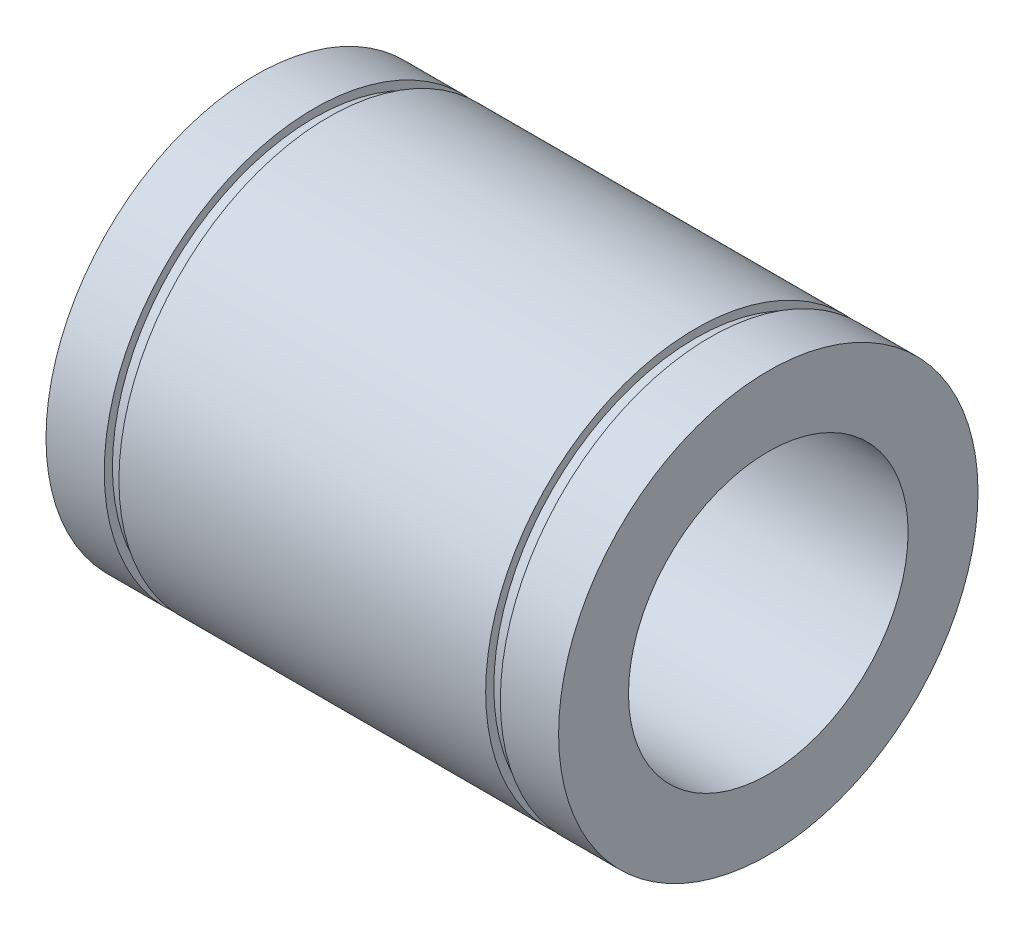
ISO-10303-21;
HEADER;
FILE_DESCRIPTION(('STEP AP214'),'2;1');
FILE_NAME('part.step','',(''),(''),'','','');
FILE_SCHEMA(('AUTOMOTIVE_DESIGN { 1 0 10303 214 1 1 1 1 }'));
ENDSEC;
DATA;
#1=APPLICATION_CONTEXT('core data for automotive mechanical design processes');
#2=APPLICATION_PROTOCOL_DEFINITION('international standard','automotive_design',2000,#1);
#3=PRODUCT_CONTEXT('',#1,'mechanical');
#4=PRODUCT('Part','Part','',(#3));
#5=PRODUCT_RELATED_PRODUCT_CATEGORY('part','',(#4));
#6=PRODUCT_DEFINITION_FORMATION('','',#4);
#7=PRODUCT_DEFINITION_CONTEXT('part definition',#1,'design');
#8=PRODUCT_DEFINITION('design','',#6,#7);
#9=PRODUCT_DEFINITION_SHAPE('','',#8);
#10=(LENGTH_UNIT() NAMED_UNIT(*) SI_UNIT(.MILLI.,.METRE.));
#11=(NAMED_UNIT(*) PLANE_ANGLE_UNIT() SI_UNIT($,.RADIAN.));
#12=(NAMED_UNIT(*) SI_UNIT($,.STERADIAN.) SOLID_ANGLE_UNIT());
#13=UNCERTAINTY_MEASURE_WITH_UNIT(LENGTH_MEASURE(1.E-05),#10,'distance_accuracy_value','');
#14=(GEOMETRIC_REPRESENTATION_CONTEXT(3) GLOBAL_UNCERTAINTY_ASSIGNED_CONTEXT((#13)) GLOBAL_UNIT_ASSIGNED_CONTEXT((#10,
#11,#12)) REPRESENTATION_CONTEXT('',''));
#15=CARTESIAN_POINT('',(0.,0.,0.));
#16=DIRECTION('',(0.,0.,1.));
#17=DIRECTION('',(1.,0.,0.));
#18=AXIS2_PLACEMENT_3D('',#15,#16,#17);
#19=CARTESIAN_POINT('',(55.,0.,0.));
#20=DIRECTION('',(-1.,0.,0.));
#21=DIRECTION('',(0.,0.,-1.));
#22=AXIS2_PLACEMENT_3D('',#19,#20,#21);
#23=CYLINDRICAL_SURFACE('',#22,45.);
#24=CARTESIAN_POINT('',(-55.,0.,0.));
#25=DIRECTION('',(1.,0.,0.));
#26=DIRECTION('',(0.,0.,-1.));
#27=AXIS2_PLACEMENT_3D('',#24,#25,#26);
#28=CIRCLE('',#27,45.);
#29=CARTESIAN_POINT('',(-55.,0.,-45.));
#30=VERTEX_POINT('',#29);
#31=CARTESIAN_POINT('',(-55.,0.,45.));
#32=VERTEX_POINT('',#31);
#33=EDGE_CURVE('E210',#30,#32,#28,.T.);
#34=ORIENTED_EDGE('',*,*,#33,.T.);
#35=DIRECTION('',(1.,0.,0.));
#36=VECTOR('',#35,1.);
#37=CARTESIAN_POINT('',(55.,0.,45.));
#38=LINE('',#37,#36);
#39=CARTESIAN_POINT('',(-42.5,0.,45.));
#40=VERTEX_POINT('',#39);
#41=EDGE_CURVE('E10',#32,#40,#38,.T.);
#42=ORIENTED_EDGE('',*,*,#41,.T.);
#43=CARTESIAN_POINT('',(-42.5,0.,0.));
#44=DIRECTION('',(1.,0.,0.));
#45=DIRECTION('',(0.,0.,-1.));
#46=AXIS2_PLACEMENT_3D('',#43,#44,#45);
#47=CIRCLE('',#46,45.);
#48=CARTESIAN_POINT('',(-42.5,0.,-45.));
#49=VERTEX_POINT('',#48);
#50=EDGE_CURVE('E59',#49,#40,#47,.T.);
#51=ORIENTED_EDGE('',*,*,#50,.F.);
#52=CARTESIAN_POINT('',(-42.5,0.,0.));
#53=DIRECTION('',(1.,0.,0.));
#54=DIRECTION('',(0.,0.,-1.));
#55=AXIS2_PLACEMENT_3D('',#52,#53,#54);
#56=CIRCLE('',#55,45.);
#57=EDGE_CURVE('E25',#40,#49,#56,.T.);
#58=ORIENTED_EDGE('',*,*,#57,.F.);
#59=ORIENTED_EDGE('',*,*,#41,.F.);
#60=CARTESIAN_POINT('',(-55.,0.,0.));
#61=DIRECTION('',(1.,0.,0.));
#62=DIRECTION('',(0.,0.,-1.));
#63=AXIS2_PLACEMENT_3D('',#60,#61,#62);
#64=CIRCLE('',#63,45.);
#65=EDGE_CURVE('E208',#32,#30,#64,.T.);
#66=ORIENTED_EDGE('',*,*,#65,.T.);
#67=EDGE_LOOP('',(#34,#42,#51,#58,#59,#66));
#68=FACE_BOUND('',#67,.T.);
#69=ADVANCED_FACE('F16',(#68),#23,.T.);
#70=CARTESIAN_POINT('',(-42.5,43.25,0.));
#71=DIRECTION('',(1.,0.,0.));
#72=DIRECTION('',(0.,1.,0.));
#73=AXIS2_PLACEMENT_3D('',#70,#71,#72);
#74=PLANE('',#73);
#75=CARTESIAN_POINT('',(-42.5,0.,0.));
#76=DIRECTION('',(1.,0.,0.));
#77=DIRECTION('',(0.,0.,-1.));
#78=AXIS2_PLACEMENT_3D('',#75,#76,#77);
#79=CIRCLE('',#78,43.25);
#80=CARTESIAN_POINT('',(-42.5,0.,-43.25));
#81=VERTEX_POINT('',#80);
#82=CARTESIAN_POINT('',(-42.5,0.,43.25));
#83=VERTEX_POINT('',#82);
#84=EDGE_CURVE('E56',#81,#83,#79,.T.);
#85=ORIENTED_EDGE('',*,*,#84,.F.);
#86=CARTESIAN_POINT('',(-42.5,0.,0.));
#87=DIRECTION('',(1.,0.,0.));
#88=DIRECTION('',(0.,0.,-1.));
#89=AXIS2_PLACEMENT_3D('',#86,#87,#88);
#90=CIRCLE('',#89,43.25);
#91=EDGE_CURVE('E51',#83,#81,#90,.T.);
#92=ORIENTED_EDGE('',*,*,#91,.F.);
#93=EDGE_LOOP('',(#85,#92));
#94=FACE_BOUND('',#93,.T.);
#95=ORIENTED_EDGE('',*,*,#50,.T.);
#96=ORIENTED_EDGE('',*,*,#57,.T.);
#97=EDGE_LOOP('',(#95,#96));
#98=FACE_BOUND('',#97,.T.);
#99=ADVANCED_FACE('F53',(#94,#98),#74,.T.);
#100=CARTESIAN_POINT('',(55.,0.,0.));
#101=DIRECTION('',(-1.,0.,0.));
#102=DIRECTION('',(0.,0.,-1.));
#103=AXIS2_PLACEMENT_3D('',#100,#101,#102);
#104=CYLINDRICAL_SURFACE('',#103,43.25);
#105=ORIENTED_EDGE('',*,*,#84,.T.);
#106=DIRECTION('',(1.,0.,0.));
#107=VECTOR('',#106,1.);
#108=CARTESIAN_POINT('',(55.,0.,43.25));
#109=LINE('',#108,#107);
#110=CARTESIAN_POINT('',(-39.35,0.,43.25));
#111=VERTEX_POINT('',#110);
#112=EDGE_CURVE('E60',#83,#111,#109,.T.);
#113=ORIENTED_EDGE('',*,*,#112,.T.);
#114=CARTESIAN_POINT('',(-39.35,0.,0.));
#115=DIRECTION('',(1.,0.,0.));
#116=DIRECTION('',(0.,0.,-1.));
#117=AXIS2_PLACEMENT_3D('',#114,#115,#116);
#118=CIRCLE('',#117,43.25);
#119=CARTESIAN_POINT('',(-39.35,0.,-43.25));
#120=VERTEX_POINT('',#119);
#121=EDGE_CURVE('E77',#120,#111,#118,.T.);
#122=ORIENTED_EDGE('',*,*,#121,.F.);
#123=CARTESIAN_POINT('',(-39.35,0.,0.));
#124=DIRECTION('',(1.,0.,0.));
#125=DIRECTION('',(0.,0.,-1.));
#126=AXIS2_PLACEMENT_3D('',#123,#124,#125);
#127=CIRCLE('',#126,43.25);
#128=EDGE_CURVE('E67',#111,#120,#127,.T.);
#129=ORIENTED_EDGE('',*,*,#128,.F.);
#130=ORIENTED_EDGE('',*,*,#112,.F.);
#131=ORIENTED_EDGE('',*,*,#91,.T.);
#132=EDGE_LOOP('',(#105,#113,#122,#129,#130,#131));
#133=FACE_BOUND('',#132,.T.);
#134=ADVANCED_FACE('F64',(#133),#104,.T.);
#135=CARTESIAN_POINT('',(-39.35,45.,0.));
#136=DIRECTION('',(-1.,0.,0.));
#137=DIRECTION('',(0.,0.,1.));
#138=AXIS2_PLACEMENT_3D('',#135,#136,#137);
#139=PLANE('',#138);
#140=ORIENTED_EDGE('',*,*,#121,.T.);
#141=ORIENTED_EDGE('',*,*,#128,.T.);
#142=EDGE_LOOP('',(#140,#141));
#143=FACE_BOUND('',#142,.T.);
#144=CARTESIAN_POINT('',(-39.35,0.,0.));
#145=DIRECTION('',(1.,0.,0.));
#146=DIRECTION('',(0.,0.,-1.));
#147=AXIS2_PLACEMENT_3D('',#144,#145,#146);
#148=CIRCLE('',#147,45.);
#149=CARTESIAN_POINT('',(-39.35,0.,-45.));
#150=VERTEX_POINT('',#149);
#151=CARTESIAN_POINT('',(-39.35,0.,45.));
#152=VERTEX_POINT('',#151);
#153=EDGE_CURVE('E114',#150,#152,#148,.T.);
#154=ORIENTED_EDGE('',*,*,#153,.F.);
#155=CARTESIAN_POINT('',(-39.35,0.,0.));
#156=DIRECTION('',(1.,0.,0.));
#157=DIRECTION('',(0.,0.,-1.));
#158=AXIS2_PLACEMENT_3D('',#155,#156,#157);
#159=CIRCLE('',#158,45.);
#160=EDGE_CURVE('E121',#152,#150,#159,.T.);
#161=ORIENTED_EDGE('',*,*,#160,.F.);
#162=EDGE_LOOP('',(#154,#161));
#163=FACE_BOUND('',#162,.T.);
#164=ADVANCED_FACE('F135',(#143,#163),#139,.T.);
#165=CARTESIAN_POINT('',(55.,0.,0.));
#166=DIRECTION('',(-1.,0.,0.));
#167=DIRECTION('',(0.,0.,-1.));
#168=AXIS2_PLACEMENT_3D('',#165,#166,#167);
#169=CYLINDRICAL_SURFACE('',#168,45.);
#170=ORIENTED_EDGE('',*,*,#153,.T.);
#171=DIRECTION('',(1.,0.,0.));
#172=VECTOR('',#171,1.);
#173=CARTESIAN_POINT('',(55.,0.,45.));
#174=LINE('',#173,#172);
#175=CARTESIAN_POINT('',(39.35,0.,45.));
#176=VERTEX_POINT('',#175);
#177=EDGE_CURVE('E118',#152,#176,#174,.T.);
#178=ORIENTED_EDGE('',*,*,#177,.T.);
#179=CARTESIAN_POINT('',(39.35,0.,0.));
#180=DIRECTION('',(1.,0.,0.));
#181=DIRECTION('',(0.,0.,-1.));
#182=AXIS2_PLACEMENT_3D('',#179,#180,#181);
#183=CIRCLE('',#182,45.);
#184=CARTESIAN_POINT('',(39.35,0.,-45.));
#185=VERTEX_POINT('',#184);
#186=EDGE_CURVE('E106',#185,#176,#183,.T.);
#187=ORIENTED_EDGE('',*,*,#186,.F.);
#188=CARTESIAN_POINT('',(39.35,0.,0.));
#189=DIRECTION('',(1.,0.,0.));
#190=DIRECTION('',(0.,0.,-1.));
#191=AXIS2_PLACEMENT_3D('',#188,#189,#190);
#192=CIRCLE('',#191,45.);
#193=EDGE_CURVE('E110',#176,#185,#192,.T.);
#194=ORIENTED_EDGE('',*,*,#193,.F.);
#195=ORIENTED_EDGE('',*,*,#177,.F.);
#196=ORIENTED_EDGE('',*,*,#160,.T.);
#197=EDGE_LOOP('',(#170,#178,#187,#194,#195,#196));
#198=FACE_BOUND('',#197,.T.);
#199=ADVANCED_FACE('F289',(#198),#169,.T.);
#200=CARTESIAN_POINT('',(39.35,43.25,0.));
#201=DIRECTION('',(1.,0.,0.));
#202=DIRECTION('',(0.,1.,0.));
#203=AXIS2_PLACEMENT_3D('',#200,#201,#202);
#204=PLANE('',#203);
#205=CARTESIAN_POINT('',(39.35,0.,0.));
#206=DIRECTION('',(1.,0.,0.));
#207=DIRECTION('',(0.,0.,-1.));
#208=AXIS2_PLACEMENT_3D('',#205,#206,#207);
#209=CIRCLE('',#208,43.25);
#210=CARTESIAN_POINT('',(39.35,0.,-43.25));
#211=VERTEX_POINT('',#210);
#212=CARTESIAN_POINT('',(39.35,0.,43.25));
#213=VERTEX_POINT('',#212);
#214=EDGE_CURVE('E97',#211,#213,#209,.T.);
#215=ORIENTED_EDGE('',*,*,#214,.F.);
#216=CARTESIAN_POINT('',(39.35,0.,0.));
#217=DIRECTION('',(1.,0.,0.));
#218=DIRECTION('',(0.,0.,-1.));
#219=AXIS2_PLACEMENT_3D('',#216,#217,#218);
#220=CIRCLE('',#219,43.25);
#221=EDGE_CURVE('E102',#213,#211,#220,.T.);
#222=ORIENTED_EDGE('',*,*,#221,.F.);
#223=EDGE_LOOP('',(#215,#222));
#224=FACE_BOUND('',#223,.T.);
#225=ORIENTED_EDGE('',*,*,#186,.T.);
#226=ORIENTED_EDGE('',*,*,#193,.T.);
#227=EDGE_LOOP('',(#225,#226));
#228=FACE_BOUND('',#227,.T.);
#229=ADVANCED_FACE('F291',(#224,#228),#204,.T.);
#230=CARTESIAN_POINT('',(55.,0.,0.));
#231=DIRECTION('',(-1.,0.,0.));
#232=DIRECTION('',(0.,0.,-1.));
#233=AXIS2_PLACEMENT_3D('',#230,#231,#232);
#234=CYLINDRICAL_SURFACE('',#233,43.25);
#235=ORIENTED_EDGE('',*,*,#214,.T.);
#236=DIRECTION('',(1.,0.,0.));
#237=VECTOR('',#236,1.);
#238=CARTESIAN_POINT('',(55.,0.,43.25));
#239=LINE('',#238,#237);
#240=CARTESIAN_POINT('',(42.5,0.,43.25));
#241=VERTEX_POINT('',#240);
#242=EDGE_CURVE('E101',#213,#241,#239,.T.);
#243=ORIENTED_EDGE('',*,*,#242,.T.);
#244=CARTESIAN_POINT('',(42.5,0.,0.));
#245=DIRECTION('',(1.,0.,0.));
#246=DIRECTION('',(0.,0.,-1.));
#247=AXIS2_PLACEMENT_3D('',#244,#245,#246);
#248=CIRCLE('',#247,43.25);
#249=CARTESIAN_POINT('',(42.5,0.,-43.25));
#250=VERTEX_POINT('',#249);
#251=EDGE_CURVE('E92',#250,#241,#248,.T.);
#252=ORIENTED_EDGE('',*,*,#251,.F.);
#253=CARTESIAN_POINT('',(42.5,0.,0.));
#254=DIRECTION('',(1.,0.,0.));
#255=DIRECTION('',(0.,0.,-1.));
#256=AXIS2_PLACEMENT_3D('',#253,#254,#255);
#257=CIRCLE('',#256,43.25);
#258=EDGE_CURVE('E91',#241,#250,#257,.T.);
#259=ORIENTED_EDGE('',*,*,#258,.F.);
#260=ORIENTED_EDGE('',*,*,#242,.F.);
#261=ORIENTED_EDGE('',*,*,#221,.T.);
#262=EDGE_LOOP('',(#235,#243,#252,#259,#260,#261));
#263=FACE_BOUND('',#262,.T.);
#264=ADVANCED_FACE('F294',(#263),#234,.T.);
#265=CARTESIAN_POINT('',(42.5,45.,0.));
#266=DIRECTION('',(-1.,0.,0.));
#267=DIRECTION('',(0.,0.,1.));
#268=AXIS2_PLACEMENT_3D('',#265,#266,#267);
#269=PLANE('',#268);
#270=ORIENTED_EDGE('',*,*,#251,.T.);
#271=ORIENTED_EDGE('',*,*,#258,.T.);
#272=EDGE_LOOP('',(#270,#271));
#273=FACE_BOUND('',#272,.T.);
#274=CARTESIAN_POINT('',(42.5,0.,0.));
#275=DIRECTION('',(1.,0.,0.));
#276=DIRECTION('',(0.,0.,-1.));
#277=AXIS2_PLACEMENT_3D('',#274,#275,#276);
#278=CIRCLE('',#277,45.);
#279=CARTESIAN_POINT('',(42.5,0.,-45.));
#280=VERTEX_POINT('',#279);
#281=CARTESIAN_POINT('',(42.5,0.,45.));
#282=VERTEX_POINT('',#281);
#283=EDGE_CURVE('E224',#280,#282,#278,.T.);
#284=ORIENTED_EDGE('',*,*,#283,.F.);
#285=CARTESIAN_POINT('',(42.5,0.,0.));
#286=DIRECTION('',(1.,0.,0.));
#287=DIRECTION('',(0.,0.,-1.));
#288=AXIS2_PLACEMENT_3D('',#285,#286,#287);
#289=CIRCLE('',#288,45.);
#290=EDGE_CURVE('E96',#282,#280,#289,.T.);
#291=ORIENTED_EDGE('',*,*,#290,.F.);
#292=EDGE_LOOP('',(#284,#291));
#293=FACE_BOUND('',#292,.T.);
#294=ADVANCED_FACE('F263',(#273,#293),#269,.T.);
#295=CARTESIAN_POINT('',(55.,0.,0.));
#296=DIRECTION('',(-1.,0.,0.));
#297=DIRECTION('',(0.,0.,-1.));
#298=AXIS2_PLACEMENT_3D('',#295,#296,#297);
#299=CYLINDRICAL_SURFACE('',#298,45.);
#300=ORIENTED_EDGE('',*,*,#283,.T.);
#301=DIRECTION('',(1.,0.,0.));
#302=VECTOR('',#301,1.);
#303=CARTESIAN_POINT('',(55.,0.,45.));
#304=LINE('',#303,#302);
#305=CARTESIAN_POINT('',(55.,0.,45.));
#306=VERTEX_POINT('',#305);
#307=EDGE_CURVE('E221',#282,#306,#304,.T.);
#308=ORIENTED_EDGE('',*,*,#307,.T.);
#309=CARTESIAN_POINT('',(55.,0.,0.));
#310=DIRECTION('',(1.,0.,0.));
#311=DIRECTION('',(0.,0.,-1.));
#312=AXIS2_PLACEMENT_3D('',#309,#310,#311);
#313=CIRCLE('',#312,45.);
#314=CARTESIAN_POINT('',(55.,0.,-45.));
#315=VERTEX_POINT('',#314);
#316=EDGE_CURVE('E241',#315,#306,#313,.T.);
#317=ORIENTED_EDGE('',*,*,#316,.F.);
#318=CARTESIAN_POINT('',(55.,0.,0.));
#319=DIRECTION('',(1.,0.,0.));
#320=DIRECTION('',(0.,0.,-1.));
#321=AXIS2_PLACEMENT_3D('',#318,#319,#320);
#322=CIRCLE('',#321,45.);
#323=EDGE_CURVE('E245',#306,#315,#322,.T.);
#324=ORIENTED_EDGE('',*,*,#323,.F.);
#325=ORIENTED_EDGE('',*,*,#307,.F.);
#326=ORIENTED_EDGE('',*,*,#290,.T.);
#327=EDGE_LOOP('',(#300,#308,#317,#324,#325,#326));
#328=FACE_BOUND('',#327,.T.);
#329=ADVANCED_FACE('F258',(#328),#299,.T.);
#330=CARTESIAN_POINT('',(55.,30.,0.));
#331=DIRECTION('',(1.,0.,0.));
#332=DIRECTION('',(0.,1.,0.));
#333=AXIS2_PLACEMENT_3D('',#330,#331,#332);
#334=PLANE('',#333);
#335=CARTESIAN_POINT('',(55.,0.,0.));
#336=DIRECTION('',(1.,0.,0.));
#337=DIRECTION('',(0.,0.,-1.));
#338=AXIS2_PLACEMENT_3D('',#335,#336,#337);
#339=CIRCLE('',#338,30.);
#340=CARTESIAN_POINT('',(55.,0.,-30.));
#341=VERTEX_POINT('',#340);
#342=CARTESIAN_POINT('',(55.,0.,30.));
#343=VERTEX_POINT('',#342);
#344=EDGE_CURVE('E231',#341,#343,#339,.T.);
#345=ORIENTED_EDGE('',*,*,#344,.F.);
#346=CARTESIAN_POINT('',(55.,0.,0.));
#347=DIRECTION('',(1.,0.,0.));
#348=DIRECTION('',(0.,0.,-1.));
#349=AXIS2_PLACEMENT_3D('',#346,#347,#348);
#350=CIRCLE('',#349,30.);
#351=EDGE_CURVE('E240',#343,#341,#350,.T.);
#352=ORIENTED_EDGE('',*,*,#351,.F.);
#353=EDGE_LOOP('',(#345,#352));
#354=FACE_BOUND('',#353,.T.);
#355=ORIENTED_EDGE('',*,*,#316,.T.);
#356=ORIENTED_EDGE('',*,*,#323,.T.);
#357=EDGE_LOOP('',(#355,#356));
#358=FACE_BOUND('',#357,.T.);
#359=ADVANCED_FACE('F265',(#354,#358),#334,.T.);
#360=CARTESIAN_POINT('',(55.,0.,0.));
#361=DIRECTION('',(-1.,0.,0.));
#362=DIRECTION('',(0.,0.,-1.));
#363=AXIS2_PLACEMENT_3D('',#360,#361,#362);
#364=CYLINDRICAL_SURFACE('',#363,30.);
#365=ORIENTED_EDGE('',*,*,#344,.T.);
#366=DIRECTION('',(-1.,0.,0.));
#367=VECTOR('',#366,1.);
#368=CARTESIAN_POINT('',(55.,0.,30.));
#369=LINE('',#368,#367);
#370=CARTESIAN_POINT('',(-55.,0.,30.));
#371=VERTEX_POINT('',#370);
#372=EDGE_CURVE('E236',#343,#371,#369,.T.);
#373=ORIENTED_EDGE('',*,*,#372,.T.);
#374=CARTESIAN_POINT('',(-55.,0.,0.));
#375=DIRECTION('',(1.,0.,0.));
#376=DIRECTION('',(0.,0.,-1.));
#377=AXIS2_PLACEMENT_3D('',#374,#375,#376);
#378=CIRCLE('',#377,30.);
#379=CARTESIAN_POINT('',(-55.,0.,-30.));
#380=VERTEX_POINT('',#379);
#381=EDGE_CURVE('E213',#380,#371,#378,.T.);
#382=ORIENTED_EDGE('',*,*,#381,.F.);
#383=CARTESIAN_POINT('',(-55.,0.,0.));
#384=DIRECTION('',(1.,0.,0.));
#385=DIRECTION('',(0.,0.,-1.));
#386=AXIS2_PLACEMENT_3D('',#383,#384,#385);
#387=CIRCLE('',#386,30.);
#388=EDGE_CURVE('E228',#371,#380,#387,.T.);
#389=ORIENTED_EDGE('',*,*,#388,.F.);
#390=ORIENTED_EDGE('',*,*,#372,.F.);
#391=ORIENTED_EDGE('',*,*,#351,.T.);
#392=EDGE_LOOP('',(#365,#373,#382,#389,#390,#391));
#393=FACE_BOUND('',#392,.T.);
#394=ADVANCED_FACE('F267',(#393),#364,.F.);
#395=CARTESIAN_POINT('',(-55.,45.,0.));
#396=DIRECTION('',(-1.,0.,0.));
#397=DIRECTION('',(0.,0.,1.));
#398=AXIS2_PLACEMENT_3D('',#395,#396,#397);
#399=PLANE('',#398);
#400=ORIENTED_EDGE('',*,*,#381,.T.);
#401=ORIENTED_EDGE('',*,*,#388,.T.);
#402=EDGE_LOOP('',(#400,#401));
#403=FACE_BOUND('',#402,.T.);
#404=ORIENTED_EDGE('',*,*,#33,.F.);
#405=ORIENTED_EDGE('',*,*,#65,.F.);
#406=EDGE_LOOP('',(#404,#405));
#407=FACE_BOUND('',#406,.T.);
#408=ADVANCED_FACE('F215',(#403,#407),#399,.T.);
#409=CLOSED_SHELL('',(#69,#99,#134,#164,#199,#229,#264,#294,#329,#359,#394,#408));
#410=MANIFOLD_SOLID_BREP('B1',#409);
#411=ADVANCED_BREP_SHAPE_REPRESENTATION('',(#18,#410),#14);
#412=SHAPE_DEFINITION_REPRESENTATION(#9,#411);
ENDSEC;
END-ISO-10303-21;
